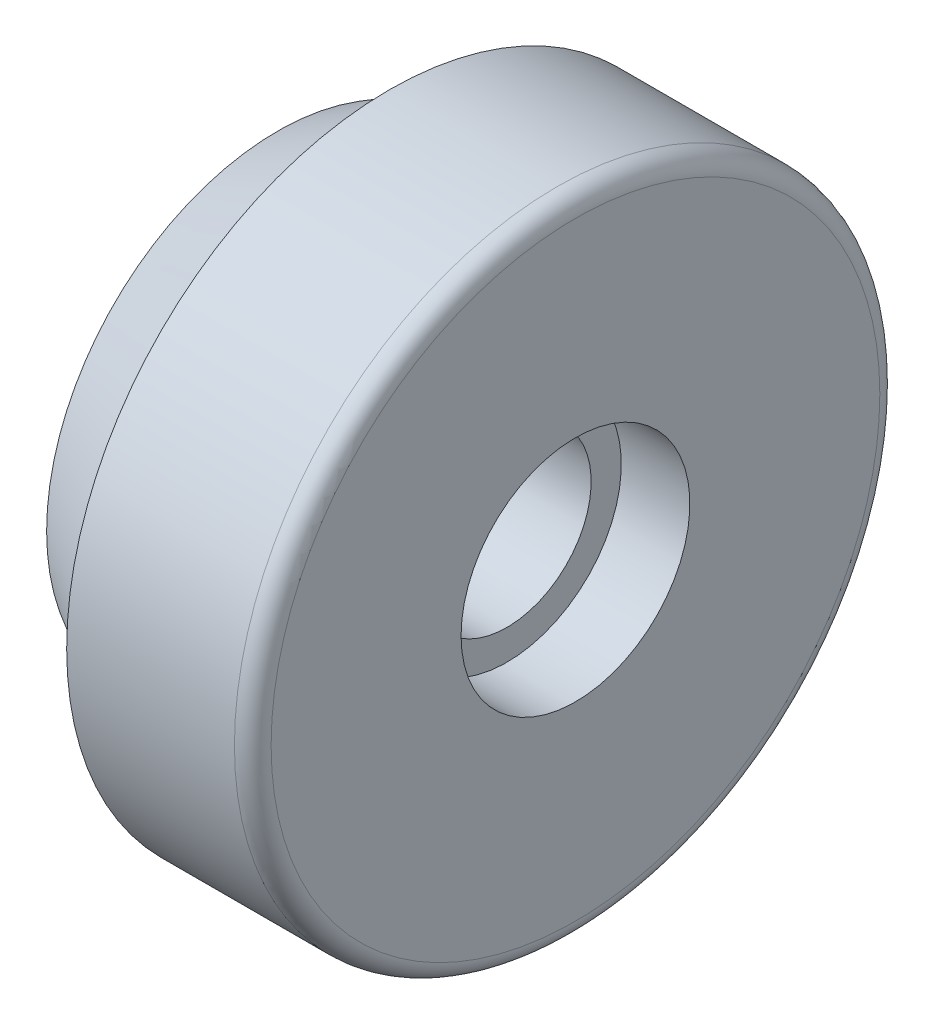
from build123d import *


with BuildPart() as part:
    # Sketch1 → Revolve1 (revolve)
    with BuildSketch(Plane.XY, mode=Mode.PRIVATE) as revolve1_sk:
        with BuildLine():
            Line((-17.4625, 55.88), (-46.51375, 55.88))
            Line((-46.51375, 55.88), (-46.51375, 51.166617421))
            Line((-46.51375, 51.166617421), (-65.88125, 39.984786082))
            Line((-65.88125, 39.984786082), (-65.88125, 0))
            Line((-65.88125, 0), (-49.435511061, 0))
            Line((-49.435511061, 0), (-49.435511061, 14.592747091))
            Line((-49.435511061, 14.592747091), (-26.162, 14.592747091))
            Line((-26.162, 14.592747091), (-26.162, 19.812))
            Line((-26.162, 19.812), (-14.2875, 19.812))
            Line((-14.2875, 19.812), (-14.2875, 52.705))
            ThreePointArc((-14.2875, 52.705), (-15.21743597, 54.95006403), (-17.4625, 55.88))
        make_face()
    revolve(revolve1_sk.sketch.rotate(Axis((0, 0, 0), (1, 0, 0)), 90), axis=Axis((0, 0, 0), (1, 0, 0)))


solid = part.part
